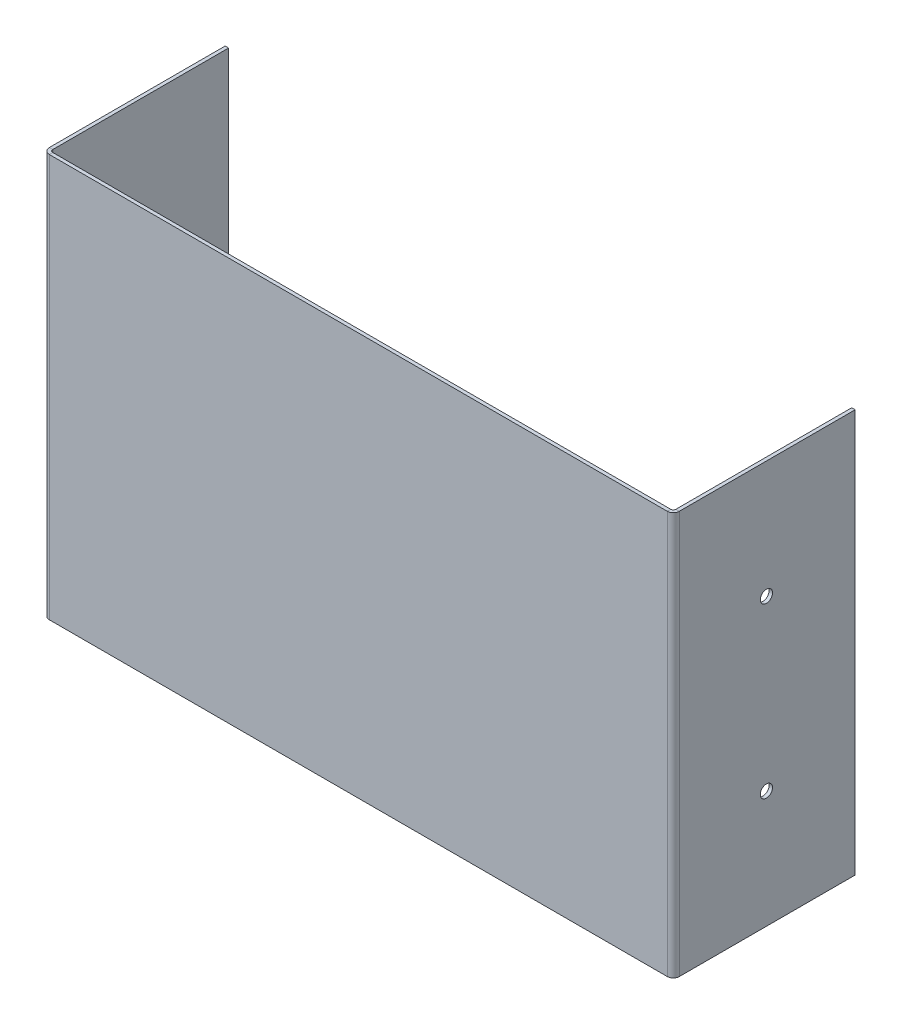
ISO-10303-21;
HEADER;
FILE_DESCRIPTION(('STEP AP214'),'2;1');
FILE_NAME('part.step','',(''),(''),'','','');
FILE_SCHEMA(('AUTOMOTIVE_DESIGN { 1 0 10303 214 1 1 1 1 }'));
ENDSEC;
DATA;
#1=APPLICATION_CONTEXT('core data for automotive mechanical design processes');
#2=APPLICATION_PROTOCOL_DEFINITION('international standard','automotive_design',2000,#1);
#3=PRODUCT_CONTEXT('',#1,'mechanical');
#4=PRODUCT('Part','Part','',(#3));
#5=PRODUCT_RELATED_PRODUCT_CATEGORY('part','',(#4));
#6=PRODUCT_DEFINITION_FORMATION('','',#4);
#7=PRODUCT_DEFINITION_CONTEXT('part definition',#1,'design');
#8=PRODUCT_DEFINITION('design','',#6,#7);
#9=PRODUCT_DEFINITION_SHAPE('','',#8);
#10=(LENGTH_UNIT() NAMED_UNIT(*) SI_UNIT(.MILLI.,.METRE.));
#11=(NAMED_UNIT(*) PLANE_ANGLE_UNIT() SI_UNIT($,.RADIAN.));
#12=(NAMED_UNIT(*) SI_UNIT($,.STERADIAN.) SOLID_ANGLE_UNIT());
#13=UNCERTAINTY_MEASURE_WITH_UNIT(LENGTH_MEASURE(1.E-05),#10,'distance_accuracy_value','');
#14=(GEOMETRIC_REPRESENTATION_CONTEXT(3) GLOBAL_UNCERTAINTY_ASSIGNED_CONTEXT((#13)) GLOBAL_UNIT_ASSIGNED_CONTEXT((#10,
#11,#12)) REPRESENTATION_CONTEXT('',''));
#15=CARTESIAN_POINT('',(0.,0.,0.));
#16=DIRECTION('',(0.,0.,1.));
#17=DIRECTION('',(1.,0.,0.));
#18=AXIS2_PLACEMENT_3D('',#15,#16,#17);
#19=CARTESIAN_POINT('',(-90.1446,-57.658,-0.9906));
#20=DIRECTION('',(0.,0.,1.));
#21=DIRECTION('',(1.,0.,0.));
#22=AXIS2_PLACEMENT_3D('',#19,#20,#21);
#23=PLANE('',#22);
#24=DIRECTION('',(0.,-1.,0.));
#25=VECTOR('',#24,1.);
#26=CARTESIAN_POINT('',(88.4174,-57.658,-0.990600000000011));
#27=LINE('',#26,#25);
#28=CARTESIAN_POINT('',(88.4174,-57.658,-0.990600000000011));
#29=VERTEX_POINT('',#28);
#30=CARTESIAN_POINT('',(88.4174,57.658,-0.990600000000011));
#31=VERTEX_POINT('',#30);
#32=EDGE_CURVE('E217',#29,#31,#27,.F.);
#33=ORIENTED_EDGE('',*,*,#32,.F.);
#34=DIRECTION('',(1.,0.,0.));
#35=VECTOR('',#34,1.);
#36=CARTESIAN_POINT('',(-90.1446,-57.658,-0.9906));
#37=LINE('',#36,#35);
#38=CARTESIAN_POINT('',(-88.4174,-57.658,-0.990600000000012));
#39=VERTEX_POINT('',#38);
#40=EDGE_CURVE('E81',#39,#29,#37,.T.);
#41=ORIENTED_EDGE('',*,*,#40,.F.);
#42=DIRECTION('',(0.,1.,0.));
#43=VECTOR('',#42,1.);
#44=CARTESIAN_POINT('',(-88.4174,57.658,-0.990599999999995));
#45=LINE('',#44,#43);
#46=CARTESIAN_POINT('',(-88.4174,57.658,-0.990599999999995));
#47=VERTEX_POINT('',#46);
#48=EDGE_CURVE('E268',#47,#39,#45,.F.);
#49=ORIENTED_EDGE('',*,*,#48,.F.);
#50=DIRECTION('',(-1.,0.,0.));
#51=VECTOR('',#50,1.);
#52=CARTESIAN_POINT('',(-90.1446,57.658,-0.9906));
#53=LINE('',#52,#51);
#54=EDGE_CURVE('E13',#31,#47,#53,.T.);
#55=ORIENTED_EDGE('',*,*,#54,.F.);
#56=EDGE_LOOP('',(#33,#41,#49,#55));
#57=FACE_BOUND('',#56,.T.);
#58=ADVANCED_FACE('F72',(#57),#23,.F.);
#59=CARTESIAN_POINT('',(-90.1446,-57.658,0.));
#60=DIRECTION('',(0.,0.,1.));
#61=DIRECTION('',(1.,0.,0.));
#62=AXIS2_PLACEMENT_3D('',#59,#60,#61);
#63=PLANE('',#62);
#64=DIRECTION('',(1.,0.,0.));
#65=VECTOR('',#64,1.);
#66=CARTESIAN_POINT('',(-90.1446,-57.658,0.));
#67=LINE('',#66,#65);
#68=CARTESIAN_POINT('',(-88.4174,-57.658,0.));
#69=VERTEX_POINT('',#68);
#70=CARTESIAN_POINT('',(88.4174,-57.658,0.));
#71=VERTEX_POINT('',#70);
#72=EDGE_CURVE('E274',#69,#71,#67,.T.);
#73=ORIENTED_EDGE('',*,*,#72,.T.);
#74=DIRECTION('',(0.,-1.,0.));
#75=VECTOR('',#74,1.);
#76=CARTESIAN_POINT('',(88.4174,-57.658,0.));
#77=LINE('',#76,#75);
#78=CARTESIAN_POINT('',(88.4174,57.658,0.));
#79=VERTEX_POINT('',#78);
#80=EDGE_CURVE('E206',#71,#79,#77,.F.);
#81=ORIENTED_EDGE('',*,*,#80,.T.);
#82=DIRECTION('',(-1.,0.,0.));
#83=VECTOR('',#82,1.);
#84=CARTESIAN_POINT('',(-90.1446,57.658,0.));
#85=LINE('',#84,#83);
#86=CARTESIAN_POINT('',(-88.4174,57.658,0.));
#87=VERTEX_POINT('',#86);
#88=EDGE_CURVE('E76',#79,#87,#85,.T.);
#89=ORIENTED_EDGE('',*,*,#88,.T.);
#90=DIRECTION('',(0.,1.,0.));
#91=VECTOR('',#90,1.);
#92=CARTESIAN_POINT('',(-88.4174,57.658,0.));
#93=LINE('',#92,#91);
#94=EDGE_CURVE('E257',#87,#69,#93,.F.);
#95=ORIENTED_EDGE('',*,*,#94,.T.);
#96=EDGE_LOOP('',(#73,#81,#89,#95));
#97=FACE_BOUND('',#96,.T.);
#98=ADVANCED_FACE('F283',(#97),#63,.T.);
#99=CARTESIAN_POINT('',(-90.1446,-57.658,-0.9906));
#100=DIRECTION('',(0.,-1.,0.));
#101=DIRECTION('',(0.,0.,-1.));
#102=AXIS2_PLACEMENT_3D('',#99,#100,#101);
#103=PLANE('',#102);
#104=ORIENTED_EDGE('',*,*,#40,.T.);
#105=DIRECTION('',(0.,0.,1.));
#106=VECTOR('',#105,1.);
#107=CARTESIAN_POINT('',(88.4174,-57.658,-0.990600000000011));
#108=LINE('',#107,#106);
#109=EDGE_CURVE('E211',#29,#71,#108,.T.);
#110=ORIENTED_EDGE('',*,*,#109,.T.);
#111=ORIENTED_EDGE('',*,*,#72,.F.);
#112=DIRECTION('',(0.,0.,1.));
#113=VECTOR('',#112,1.);
#114=CARTESIAN_POINT('',(-88.4174,-57.658,-0.990600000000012));
#115=LINE('',#114,#113);
#116=EDGE_CURVE('E272',#39,#69,#115,.T.);
#117=ORIENTED_EDGE('',*,*,#116,.F.);
#118=EDGE_LOOP('',(#104,#110,#111,#117));
#119=FACE_BOUND('',#118,.T.);
#120=ADVANCED_FACE('F74',(#119),#103,.T.);
#121=CARTESIAN_POINT('',(-90.1446,57.658,-0.9906));
#122=DIRECTION('',(0.,1.,0.));
#123=DIRECTION('',(0.,0.,1.));
#124=AXIS2_PLACEMENT_3D('',#121,#122,#123);
#125=PLANE('',#124);
#126=DIRECTION('',(0.,0.,1.));
#127=VECTOR('',#126,1.);
#128=CARTESIAN_POINT('',(88.4174,57.658,-0.990600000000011));
#129=LINE('',#128,#127);
#130=EDGE_CURVE('E222',#31,#79,#129,.T.);
#131=ORIENTED_EDGE('',*,*,#130,.F.);
#132=ORIENTED_EDGE('',*,*,#54,.T.);
#133=DIRECTION('',(0.,0.,1.));
#134=VECTOR('',#133,1.);
#135=CARTESIAN_POINT('',(-88.4174,57.658,-0.990599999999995));
#136=LINE('',#135,#134);
#137=EDGE_CURVE('E262',#47,#87,#136,.T.);
#138=ORIENTED_EDGE('',*,*,#137,.T.);
#139=ORIENTED_EDGE('',*,*,#88,.F.);
#140=EDGE_LOOP('',(#131,#132,#138,#139));
#141=FACE_BOUND('',#140,.T.);
#142=ADVANCED_FACE('F286',(#141),#125,.T.);
#143=CARTESIAN_POINT('',(-88.4174,-57.658,-1.7272));
#144=DIRECTION('',(0.,-1.,0.));
#145=DIRECTION('',(0.,0.,-1.));
#146=AXIS2_PLACEMENT_3D('',#143,#144,#145);
#147=PLANE('',#146);
#148=DIRECTION('',(1.,0.,0.));
#149=VECTOR('',#148,1.);
#150=CARTESIAN_POINT('',(-90.1446,-57.658,-1.72719999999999));
#151=LINE('',#150,#149);
#152=CARTESIAN_POINT('',(-89.154,-57.658,-1.7272));
#153=VERTEX_POINT('',#152);
#154=CARTESIAN_POINT('',(-90.1446,-57.658,-1.7272));
#155=VERTEX_POINT('',#154);
#156=EDGE_CURVE('E224',#153,#155,#151,.F.);
#157=ORIENTED_EDGE('',*,*,#156,.F.);
#158=CARTESIAN_POINT('',(-88.4174,-57.658,-1.7272));
#159=DIRECTION('',(0.,1.,0.));
#160=DIRECTION('',(0.,0.,1.));
#161=AXIS2_PLACEMENT_3D('',#158,#159,#160);
#162=CIRCLE('',#161,0.73659999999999);
#163=EDGE_CURVE('E265',#39,#153,#162,.F.);
#164=ORIENTED_EDGE('',*,*,#163,.F.);
#165=ORIENTED_EDGE('',*,*,#116,.T.);
#166=CARTESIAN_POINT('',(-88.4174,-57.658,-1.7272));
#167=DIRECTION('',(0.,1.,0.));
#168=DIRECTION('',(0.,0.,1.));
#169=AXIS2_PLACEMENT_3D('',#166,#167,#168);
#170=CIRCLE('',#169,1.72719999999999);
#171=EDGE_CURVE('E89',#69,#155,#170,.F.);
#172=ORIENTED_EDGE('',*,*,#171,.T.);
#173=EDGE_LOOP('',(#157,#164,#165,#172));
#174=FACE_BOUND('',#173,.T.);
#175=ADVANCED_FACE('F318',(#174),#147,.T.);
#176=CARTESIAN_POINT('',(-88.4174,57.658,-1.72719999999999));
#177=DIRECTION('',(0.,-1.,0.));
#178=DIRECTION('',(0.,0.,-1.));
#179=AXIS2_PLACEMENT_3D('',#176,#177,#178);
#180=PLANE('',#179);
#181=CARTESIAN_POINT('',(-88.4174,57.658,-1.72719999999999));
#182=DIRECTION('',(0.,1.,0.));
#183=DIRECTION('',(0.,0.,1.));
#184=AXIS2_PLACEMENT_3D('',#181,#182,#183);
#185=CIRCLE('',#184,0.73659999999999);
#186=CARTESIAN_POINT('',(-89.154,57.658,-1.72719999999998));
#187=VERTEX_POINT('',#186);
#188=EDGE_CURVE('E230',#187,#47,#185,.T.);
#189=ORIENTED_EDGE('',*,*,#188,.F.);
#190=DIRECTION('',(1.,0.,0.));
#191=VECTOR('',#190,1.);
#192=CARTESIAN_POINT('',(-89.154,57.658,-1.72719999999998));
#193=LINE('',#192,#191);
#194=CARTESIAN_POINT('',(-90.1446,57.658,-1.72719999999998));
#195=VERTEX_POINT('',#194);
#196=EDGE_CURVE('E250',#187,#195,#193,.F.);
#197=ORIENTED_EDGE('',*,*,#196,.T.);
#198=CARTESIAN_POINT('',(-88.4174,57.658,-1.72719999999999));
#199=DIRECTION('',(0.,1.,0.));
#200=DIRECTION('',(0.,0.,1.));
#201=AXIS2_PLACEMENT_3D('',#198,#199,#200);
#202=CIRCLE('',#201,1.72719999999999);
#203=EDGE_CURVE('E260',#195,#87,#202,.T.);
#204=ORIENTED_EDGE('',*,*,#203,.T.);
#205=ORIENTED_EDGE('',*,*,#137,.F.);
#206=EDGE_LOOP('',(#189,#197,#204,#205));
#207=FACE_BOUND('',#206,.T.);
#208=ADVANCED_FACE('F291',(#207),#180,.F.);
#209=CARTESIAN_POINT('',(-88.4174,57.658,-1.72719999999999));
#210=DIRECTION('',(0.,1.,0.));
#211=DIRECTION('',(-1.,0.,0.));
#212=AXIS2_PLACEMENT_3D('',#209,#210,#211);
#213=CYLINDRICAL_SURFACE('',#212,1.72719999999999);
#214=ORIENTED_EDGE('',*,*,#94,.F.);
#215=ORIENTED_EDGE('',*,*,#203,.F.);
#216=DIRECTION('',(0.,1.,0.));
#217=VECTOR('',#216,1.);
#218=CARTESIAN_POINT('',(-90.1446,-57.658,-1.72719999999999));
#219=LINE('',#218,#217);
#220=EDGE_CURVE('E248',#195,#155,#219,.F.);
#221=ORIENTED_EDGE('',*,*,#220,.T.);
#222=ORIENTED_EDGE('',*,*,#171,.F.);
#223=EDGE_LOOP('',(#214,#215,#221,#222));
#224=FACE_BOUND('',#223,.T.);
#225=ADVANCED_FACE('F316',(#224),#213,.T.);
#226=CARTESIAN_POINT('',(-88.4174,57.658,-1.72719999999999));
#227=DIRECTION('',(0.,1.,0.));
#228=DIRECTION('',(-1.,0.,0.));
#229=AXIS2_PLACEMENT_3D('',#226,#227,#228);
#230=CYLINDRICAL_SURFACE('',#229,0.73659999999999);
#231=ORIENTED_EDGE('',*,*,#48,.T.);
#232=ORIENTED_EDGE('',*,*,#163,.T.);
#233=DIRECTION('',(0.,1.,0.));
#234=VECTOR('',#233,1.);
#235=CARTESIAN_POINT('',(-89.154,-57.658,-1.7272));
#236=LINE('',#235,#234);
#237=EDGE_CURVE('E253',#153,#187,#236,.T.);
#238=ORIENTED_EDGE('',*,*,#237,.T.);
#239=ORIENTED_EDGE('',*,*,#188,.T.);
#240=EDGE_LOOP('',(#231,#232,#238,#239));
#241=FACE_BOUND('',#240,.T.);
#242=ADVANCED_FACE('F294',(#241),#230,.F.);
#243=CARTESIAN_POINT('',(-90.1446000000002,57.658,-52.0446));
#244=DIRECTION('',(0.,-1.,0.));
#245=DIRECTION('',(0.,0.,-1.));
#246=AXIS2_PLACEMENT_3D('',#243,#244,#245);
#247=PLANE('',#246);
#248=ORIENTED_EDGE('',*,*,#196,.F.);
#249=DIRECTION('',(0.,0.,1.));
#250=VECTOR('',#249,1.);
#251=CARTESIAN_POINT('',(-89.1540000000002,57.658,-52.0446));
#252=LINE('',#251,#250);
#253=CARTESIAN_POINT('',(-89.1540000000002,57.658,-52.0446));
#254=VERTEX_POINT('',#253);
#255=EDGE_CURVE('E246',#187,#254,#252,.F.);
#256=ORIENTED_EDGE('',*,*,#255,.T.);
#257=DIRECTION('',(1.,0.,0.));
#258=VECTOR('',#257,1.);
#259=CARTESIAN_POINT('',(-90.1446000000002,57.658,-52.0446));
#260=LINE('',#259,#258);
#261=CARTESIAN_POINT('',(-90.1446000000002,57.658,-52.0446));
#262=VERTEX_POINT('',#261);
#263=EDGE_CURVE('E227',#262,#254,#260,.T.);
#264=ORIENTED_EDGE('',*,*,#263,.F.);
#265=DIRECTION('',(0.,0.,-1.));
#266=VECTOR('',#265,1.);
#267=CARTESIAN_POINT('',(-90.1446,57.658,-0.990600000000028));
#268=LINE('',#267,#266);
#269=EDGE_CURVE('E239',#195,#262,#268,.T.);
#270=ORIENTED_EDGE('',*,*,#269,.F.);
#271=EDGE_LOOP('',(#248,#256,#264,#270));
#272=FACE_BOUND('',#271,.T.);
#273=ADVANCED_FACE('F312',(#272),#247,.F.);
#274=CARTESIAN_POINT('',(-90.1446,-57.658,-0.990599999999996));
#275=DIRECTION('',(0.,1.,0.));
#276=DIRECTION('',(-1.,0.,0.));
#277=AXIS2_PLACEMENT_3D('',#274,#275,#276);
#278=PLANE('',#277);
#279=ORIENTED_EDGE('',*,*,#156,.T.);
#280=DIRECTION('',(0.,0.,1.));
#281=VECTOR('',#280,1.);
#282=CARTESIAN_POINT('',(-90.1446,-57.658,-0.990599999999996));
#283=LINE('',#282,#281);
#284=CARTESIAN_POINT('',(-90.1446000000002,-57.658,-52.0446));
#285=VERTEX_POINT('',#284);
#286=EDGE_CURVE('E234',#285,#155,#283,.T.);
#287=ORIENTED_EDGE('',*,*,#286,.F.);
#288=DIRECTION('',(1.,0.,0.));
#289=VECTOR('',#288,1.);
#290=CARTESIAN_POINT('',(-90.1446000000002,-57.658,-52.0446));
#291=LINE('',#290,#289);
#292=CARTESIAN_POINT('',(-89.1540000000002,-57.658,-52.0446));
#293=VERTEX_POINT('',#292);
#294=EDGE_CURVE('E231',#285,#293,#291,.T.);
#295=ORIENTED_EDGE('',*,*,#294,.T.);
#296=DIRECTION('',(0.,0.,-1.));
#297=VECTOR('',#296,1.);
#298=CARTESIAN_POINT('',(-89.154,-57.658,-0.9906));
#299=LINE('',#298,#297);
#300=EDGE_CURVE('E241',#293,#153,#299,.F.);
#301=ORIENTED_EDGE('',*,*,#300,.T.);
#302=EDGE_LOOP('',(#279,#287,#295,#301));
#303=FACE_BOUND('',#302,.T.);
#304=ADVANCED_FACE('F303',(#303),#278,.F.);
#305=CARTESIAN_POINT('',(-90.1446,-57.658,-0.990599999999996));
#306=DIRECTION('',(1.,0.,0.));
#307=DIRECTION('',(0.,0.,-1.));
#308=AXIS2_PLACEMENT_3D('',#305,#306,#307);
#309=PLANE('',#308);
#310=CARTESIAN_POINT('',(-90.1446000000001,24.13,-26.6445999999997));
#311=DIRECTION('',(-1.,0.,0.));
#312=DIRECTION('',(0.,0.,1.));
#313=AXIS2_PLACEMENT_3D('',#310,#311,#312);
#314=CIRCLE('',#313,1.75259999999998);
#315=CARTESIAN_POINT('',(-90.1446000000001,24.13,-24.8919999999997));
#316=VERTEX_POINT('',#315);
#317=EDGE_CURVE('E604',#316,#316,#314,.T.);
#318=ORIENTED_EDGE('',*,*,#317,.F.);
#319=EDGE_LOOP('',(#318));
#320=FACE_BOUND('',#319,.T.);
#321=CARTESIAN_POINT('',(-90.1446000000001,-24.13,-26.6445999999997));
#322=DIRECTION('',(-1.,0.,0.));
#323=DIRECTION('',(0.,0.,1.));
#324=AXIS2_PLACEMENT_3D('',#321,#322,#323);
#325=CIRCLE('',#324,1.7526);
#326=CARTESIAN_POINT('',(-90.1446000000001,-24.13,-24.8919999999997));
#327=VERTEX_POINT('',#326);
#328=EDGE_CURVE('E610',#327,#327,#325,.T.);
#329=ORIENTED_EDGE('',*,*,#328,.F.);
#330=EDGE_LOOP('',(#329));
#331=FACE_BOUND('',#330,.T.);
#332=ORIENTED_EDGE('',*,*,#220,.F.);
#333=ORIENTED_EDGE('',*,*,#269,.T.);
#334=DIRECTION('',(0.,-1.,0.));
#335=VECTOR('',#334,1.);
#336=CARTESIAN_POINT('',(-90.1446000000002,-57.658,-52.0446));
#337=LINE('',#336,#335);
#338=EDGE_CURVE('E237',#262,#285,#337,.T.);
#339=ORIENTED_EDGE('',*,*,#338,.T.);
#340=ORIENTED_EDGE('',*,*,#286,.T.);
#341=EDGE_LOOP('',(#332,#333,#339,#340));
#342=FACE_BOUND('',#341,.T.);
#343=ADVANCED_FACE('F315',(#320,#331,#342),#309,.F.);
#344=CARTESIAN_POINT('',(-89.154,-57.658,-0.9906));
#345=DIRECTION('',(1.,0.,0.));
#346=DIRECTION('',(0.,0.,-1.));
#347=AXIS2_PLACEMENT_3D('',#344,#345,#346);
#348=PLANE('',#347);
#349=CARTESIAN_POINT('',(-89.1540000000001,24.13,-26.6445999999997));
#350=DIRECTION('',(1.,0.,0.));
#351=DIRECTION('',(0.,0.,-1.));
#352=AXIS2_PLACEMENT_3D('',#349,#350,#351);
#353=CIRCLE('',#352,1.75259999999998);
#354=CARTESIAN_POINT('',(-89.1540000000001,24.13,-28.3971999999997));
#355=VERTEX_POINT('',#354);
#356=EDGE_CURVE('E607',#355,#355,#353,.F.);
#357=ORIENTED_EDGE('',*,*,#356,.T.);
#358=EDGE_LOOP('',(#357));
#359=FACE_BOUND('',#358,.T.);
#360=CARTESIAN_POINT('',(-89.1540000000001,-24.13,-26.6445999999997));
#361=DIRECTION('',(1.,0.,0.));
#362=DIRECTION('',(0.,0.,-1.));
#363=AXIS2_PLACEMENT_3D('',#360,#361,#362);
#364=CIRCLE('',#363,1.7526);
#365=CARTESIAN_POINT('',(-89.1540000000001,-24.13,-28.3971999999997));
#366=VERTEX_POINT('',#365);
#367=EDGE_CURVE('E205',#366,#366,#364,.F.);
#368=ORIENTED_EDGE('',*,*,#367,.T.);
#369=EDGE_LOOP('',(#368));
#370=FACE_BOUND('',#369,.T.);
#371=ORIENTED_EDGE('',*,*,#255,.F.);
#372=ORIENTED_EDGE('',*,*,#237,.F.);
#373=ORIENTED_EDGE('',*,*,#300,.F.);
#374=DIRECTION('',(0.,1.,0.));
#375=VECTOR('',#374,1.);
#376=CARTESIAN_POINT('',(-89.1540000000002,-57.658,-52.0446));
#377=LINE('',#376,#375);
#378=EDGE_CURVE('E244',#254,#293,#377,.F.);
#379=ORIENTED_EDGE('',*,*,#378,.F.);
#380=EDGE_LOOP('',(#371,#372,#373,#379));
#381=FACE_BOUND('',#380,.T.);
#382=ADVANCED_FACE('F300',(#359,#370,#381),#348,.T.);
#383=CARTESIAN_POINT('',(-90.1446000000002,-57.658,-52.0446));
#384=DIRECTION('',(0.,0.,1.));
#385=DIRECTION('',(1.,0.,0.));
#386=AXIS2_PLACEMENT_3D('',#383,#384,#385);
#387=PLANE('',#386);
#388=ORIENTED_EDGE('',*,*,#378,.T.);
#389=ORIENTED_EDGE('',*,*,#294,.F.);
#390=ORIENTED_EDGE('',*,*,#338,.F.);
#391=ORIENTED_EDGE('',*,*,#263,.T.);
#392=EDGE_LOOP('',(#388,#389,#390,#391));
#393=FACE_BOUND('',#392,.T.);
#394=ADVANCED_FACE('F308',(#393),#387,.F.);
#395=CARTESIAN_POINT('',(88.4174,57.658,-1.7272));
#396=DIRECTION('',(0.,1.,0.));
#397=DIRECTION('',(0.,0.,1.));
#398=AXIS2_PLACEMENT_3D('',#395,#396,#397);
#399=PLANE('',#398);
#400=DIRECTION('',(-1.,0.,0.));
#401=VECTOR('',#400,1.);
#402=CARTESIAN_POINT('',(90.1446,57.658,-1.72719999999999));
#403=LINE('',#402,#401);
#404=CARTESIAN_POINT('',(89.154,57.658,-1.7272));
#405=VERTEX_POINT('',#404);
#406=CARTESIAN_POINT('',(90.1446,57.658,-1.72719999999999));
#407=VERTEX_POINT('',#406);
#408=EDGE_CURVE('E187',#405,#407,#403,.F.);
#409=ORIENTED_EDGE('',*,*,#408,.F.);
#410=CARTESIAN_POINT('',(88.4174,57.658,-1.7272));
#411=DIRECTION('',(0.,-1.,0.));
#412=DIRECTION('',(0.,0.,-1.));
#413=AXIS2_PLACEMENT_3D('',#410,#411,#412);
#414=CIRCLE('',#413,0.73659999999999);
#415=EDGE_CURVE('E214',#31,#405,#414,.F.);
#416=ORIENTED_EDGE('',*,*,#415,.F.);
#417=ORIENTED_EDGE('',*,*,#130,.T.);
#418=CARTESIAN_POINT('',(88.4174,57.658,-1.7272));
#419=DIRECTION('',(0.,-1.,0.));
#420=DIRECTION('',(0.,0.,-1.));
#421=AXIS2_PLACEMENT_3D('',#418,#419,#420);
#422=CIRCLE('',#421,1.72719999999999);
#423=EDGE_CURVE('E97',#79,#407,#422,.F.);
#424=ORIENTED_EDGE('',*,*,#423,.T.);
#425=EDGE_LOOP('',(#409,#416,#417,#424));
#426=FACE_BOUND('',#425,.T.);
#427=ADVANCED_FACE('F330',(#426),#399,.T.);
#428=CARTESIAN_POINT('',(88.4174,-57.658,-1.7272));
#429=DIRECTION('',(0.,1.,0.));
#430=DIRECTION('',(0.,0.,1.));
#431=AXIS2_PLACEMENT_3D('',#428,#429,#430);
#432=PLANE('',#431);
#433=CARTESIAN_POINT('',(88.4174,-57.658,-1.7272));
#434=DIRECTION('',(0.,-1.,0.));
#435=DIRECTION('',(0.,0.,-1.));
#436=AXIS2_PLACEMENT_3D('',#433,#434,#435);
#437=CIRCLE('',#436,0.73659999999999);
#438=CARTESIAN_POINT('',(89.154,-57.658,-1.7272));
#439=VERTEX_POINT('',#438);
#440=EDGE_CURVE('E219',#439,#29,#437,.T.);
#441=ORIENTED_EDGE('',*,*,#440,.F.);
#442=DIRECTION('',(-1.,0.,0.));
#443=VECTOR('',#442,1.);
#444=CARTESIAN_POINT('',(89.154,-57.658,-1.7272));
#445=LINE('',#444,#443);
#446=CARTESIAN_POINT('',(90.1446,-57.658,-1.72719999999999));
#447=VERTEX_POINT('',#446);
#448=EDGE_CURVE('E199',#439,#447,#445,.F.);
#449=ORIENTED_EDGE('',*,*,#448,.T.);
#450=CARTESIAN_POINT('',(88.4174,-57.658,-1.7272));
#451=DIRECTION('',(0.,-1.,0.));
#452=DIRECTION('',(0.,0.,-1.));
#453=AXIS2_PLACEMENT_3D('',#450,#451,#452);
#454=CIRCLE('',#453,1.72719999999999);
#455=EDGE_CURVE('E209',#447,#71,#454,.T.);
#456=ORIENTED_EDGE('',*,*,#455,.T.);
#457=ORIENTED_EDGE('',*,*,#109,.F.);
#458=EDGE_LOOP('',(#441,#449,#456,#457));
#459=FACE_BOUND('',#458,.T.);
#460=ADVANCED_FACE('F332',(#459),#432,.F.);
#461=CARTESIAN_POINT('',(88.4174,-57.658,-1.7272));
#462=DIRECTION('',(0.,-1.,0.));
#463=DIRECTION('',(1.,0.,0.));
#464=AXIS2_PLACEMENT_3D('',#461,#462,#463);
#465=CYLINDRICAL_SURFACE('',#464,1.72719999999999);
#466=ORIENTED_EDGE('',*,*,#80,.F.);
#467=ORIENTED_EDGE('',*,*,#455,.F.);
#468=DIRECTION('',(0.,-1.,0.));
#469=VECTOR('',#468,1.);
#470=CARTESIAN_POINT('',(90.1446,57.658,-1.72719999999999));
#471=LINE('',#470,#469);
#472=EDGE_CURVE('E197',#447,#407,#471,.F.);
#473=ORIENTED_EDGE('',*,*,#472,.T.);
#474=ORIENTED_EDGE('',*,*,#423,.F.);
#475=EDGE_LOOP('',(#466,#467,#473,#474));
#476=FACE_BOUND('',#475,.T.);
#477=ADVANCED_FACE('F334',(#476),#465,.T.);
#478=CARTESIAN_POINT('',(88.4174,-57.658,-1.7272));
#479=DIRECTION('',(0.,-1.,0.));
#480=DIRECTION('',(1.,0.,0.));
#481=AXIS2_PLACEMENT_3D('',#478,#479,#480);
#482=CYLINDRICAL_SURFACE('',#481,0.73659999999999);
#483=ORIENTED_EDGE('',*,*,#32,.T.);
#484=ORIENTED_EDGE('',*,*,#415,.T.);
#485=DIRECTION('',(0.,-1.,0.));
#486=VECTOR('',#485,1.);
#487=CARTESIAN_POINT('',(89.154,57.658,-1.7272));
#488=LINE('',#487,#486);
#489=EDGE_CURVE('E202',#405,#439,#488,.T.);
#490=ORIENTED_EDGE('',*,*,#489,.T.);
#491=ORIENTED_EDGE('',*,*,#440,.T.);
#492=EDGE_LOOP('',(#483,#484,#490,#491));
#493=FACE_BOUND('',#492,.T.);
#494=ADVANCED_FACE('F326',(#493),#482,.F.);
#495=CARTESIAN_POINT('',(90.1446000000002,-57.658,-52.0446));
#496=DIRECTION('',(0.,1.,0.));
#497=DIRECTION('',(0.,0.,1.));
#498=AXIS2_PLACEMENT_3D('',#495,#496,#497);
#499=PLANE('',#498);
#500=ORIENTED_EDGE('',*,*,#448,.F.);
#501=DIRECTION('',(0.,0.,1.));
#502=VECTOR('',#501,1.);
#503=CARTESIAN_POINT('',(89.1540000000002,-57.658,-52.0446));
#504=LINE('',#503,#502);
#505=CARTESIAN_POINT('',(89.1540000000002,-57.658,-52.0446));
#506=VERTEX_POINT('',#505);
#507=EDGE_CURVE('E195',#439,#506,#504,.F.);
#508=ORIENTED_EDGE('',*,*,#507,.T.);
#509=DIRECTION('',(-1.,0.,0.));
#510=VECTOR('',#509,1.);
#511=CARTESIAN_POINT('',(90.1446000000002,-57.658,-52.0446));
#512=LINE('',#511,#510);
#513=CARTESIAN_POINT('',(90.1446000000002,-57.658,-52.0446));
#514=VERTEX_POINT('',#513);
#515=EDGE_CURVE('E183',#514,#506,#512,.T.);
#516=ORIENTED_EDGE('',*,*,#515,.F.);
#517=DIRECTION('',(0.,0.,-1.));
#518=VECTOR('',#517,1.);
#519=CARTESIAN_POINT('',(90.1446,-57.658,-0.990599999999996));
#520=LINE('',#519,#518);
#521=EDGE_CURVE('E170',#447,#514,#520,.T.);
#522=ORIENTED_EDGE('',*,*,#521,.F.);
#523=EDGE_LOOP('',(#500,#508,#516,#522));
#524=FACE_BOUND('',#523,.T.);
#525=ADVANCED_FACE('F483',(#524),#499,.F.);
#526=CARTESIAN_POINT('',(90.1446,57.658,-0.990599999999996));
#527=DIRECTION('',(0.,-1.,0.));
#528=DIRECTION('',(1.,0.,0.));
#529=AXIS2_PLACEMENT_3D('',#526,#527,#528);
#530=PLANE('',#529);
#531=ORIENTED_EDGE('',*,*,#408,.T.);
#532=DIRECTION('',(0.,0.,1.));
#533=VECTOR('',#532,1.);
#534=CARTESIAN_POINT('',(90.1446,57.658,-0.990599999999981));
#535=LINE('',#534,#533);
#536=CARTESIAN_POINT('',(90.1446000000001,57.658,-52.0446));
#537=VERTEX_POINT('',#536);
#538=EDGE_CURVE('E168',#537,#407,#535,.T.);
#539=ORIENTED_EDGE('',*,*,#538,.F.);
#540=DIRECTION('',(-1.,0.,0.));
#541=VECTOR('',#540,1.);
#542=CARTESIAN_POINT('',(90.1446000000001,57.658,-52.0446));
#543=LINE('',#542,#541);
#544=CARTESIAN_POINT('',(89.1540000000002,57.658,-52.0446));
#545=VERTEX_POINT('',#544);
#546=EDGE_CURVE('E176',#537,#545,#543,.T.);
#547=ORIENTED_EDGE('',*,*,#546,.T.);
#548=DIRECTION('',(0.,0.,-1.));
#549=VECTOR('',#548,1.);
#550=CARTESIAN_POINT('',(89.154,57.658,-0.9906));
#551=LINE('',#550,#549);
#552=EDGE_CURVE('E192',#545,#405,#551,.F.);
#553=ORIENTED_EDGE('',*,*,#552,.T.);
#554=EDGE_LOOP('',(#531,#539,#547,#553));
#555=FACE_BOUND('',#554,.T.);
#556=ADVANCED_FACE('F186',(#555),#530,.F.);
#557=CARTESIAN_POINT('',(90.1446,-57.658,-0.990599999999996));
#558=DIRECTION('',(-1.,0.,0.));
#559=DIRECTION('',(0.,0.,1.));
#560=AXIS2_PLACEMENT_3D('',#557,#558,#559);
#561=PLANE('',#560);
#562=CARTESIAN_POINT('',(90.1446000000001,-24.13,-26.6445999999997));
#563=DIRECTION('',(1.,0.,0.));
#564=DIRECTION('',(0.,0.,-1.));
#565=AXIS2_PLACEMENT_3D('',#562,#563,#564);
#566=CIRCLE('',#565,1.7526);
#567=CARTESIAN_POINT('',(90.1446000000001,-24.13,-28.3971999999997));
#568=VERTEX_POINT('',#567);
#569=EDGE_CURVE('E591',#568,#568,#566,.T.);
#570=ORIENTED_EDGE('',*,*,#569,.F.);
#571=EDGE_LOOP('',(#570));
#572=FACE_BOUND('',#571,.T.);
#573=CARTESIAN_POINT('',(90.1446000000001,24.13,-26.6445999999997));
#574=DIRECTION('',(1.,0.,0.));
#575=DIRECTION('',(0.,0.,-1.));
#576=AXIS2_PLACEMENT_3D('',#573,#574,#575);
#577=CIRCLE('',#576,1.7526);
#578=CARTESIAN_POINT('',(90.1446000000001,24.13,-28.3971999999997));
#579=VERTEX_POINT('',#578);
#580=EDGE_CURVE('E595',#579,#579,#577,.T.);
#581=ORIENTED_EDGE('',*,*,#580,.F.);
#582=EDGE_LOOP('',(#581));
#583=FACE_BOUND('',#582,.T.);
#584=ORIENTED_EDGE('',*,*,#472,.F.);
#585=ORIENTED_EDGE('',*,*,#521,.T.);
#586=DIRECTION('',(0.,1.,0.));
#587=VECTOR('',#586,1.);
#588=CARTESIAN_POINT('',(90.1446000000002,-57.658,-52.0446));
#589=LINE('',#588,#587);
#590=EDGE_CURVE('E163',#514,#537,#589,.T.);
#591=ORIENTED_EDGE('',*,*,#590,.T.);
#592=ORIENTED_EDGE('',*,*,#538,.T.);
#593=EDGE_LOOP('',(#584,#585,#591,#592));
#594=FACE_BOUND('',#593,.T.);
#595=ADVANCED_FACE('F166',(#572,#583,#594),#561,.F.);
#596=CARTESIAN_POINT('',(89.154,-57.658,-0.9906));
#597=DIRECTION('',(-1.,0.,0.));
#598=DIRECTION('',(0.,0.,1.));
#599=AXIS2_PLACEMENT_3D('',#596,#597,#598);
#600=PLANE('',#599);
#601=CARTESIAN_POINT('',(89.1540000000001,-24.13,-26.6445999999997));
#602=DIRECTION('',(-1.,0.,0.));
#603=DIRECTION('',(0.,0.,1.));
#604=AXIS2_PLACEMENT_3D('',#601,#602,#603);
#605=CIRCLE('',#604,1.7526);
#606=CARTESIAN_POINT('',(89.1540000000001,-24.13,-24.8919999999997));
#607=VERTEX_POINT('',#606);
#608=EDGE_CURVE('E594',#607,#607,#605,.F.);
#609=ORIENTED_EDGE('',*,*,#608,.T.);
#610=EDGE_LOOP('',(#609));
#611=FACE_BOUND('',#610,.T.);
#612=CARTESIAN_POINT('',(89.1540000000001,24.13,-26.6445999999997));
#613=DIRECTION('',(-1.,0.,0.));
#614=DIRECTION('',(0.,0.,1.));
#615=AXIS2_PLACEMENT_3D('',#612,#613,#614);
#616=CIRCLE('',#615,1.7526);
#617=CARTESIAN_POINT('',(89.1540000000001,24.13,-24.8919999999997));
#618=VERTEX_POINT('',#617);
#619=EDGE_CURVE('E598',#618,#618,#616,.F.);
#620=ORIENTED_EDGE('',*,*,#619,.T.);
#621=EDGE_LOOP('',(#620));
#622=FACE_BOUND('',#621,.T.);
#623=ORIENTED_EDGE('',*,*,#507,.F.);
#624=ORIENTED_EDGE('',*,*,#489,.F.);
#625=ORIENTED_EDGE('',*,*,#552,.F.);
#626=DIRECTION('',(0.,-1.,0.));
#627=VECTOR('',#626,1.);
#628=CARTESIAN_POINT('',(89.1540000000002,57.658,-52.0446));
#629=LINE('',#628,#627);
#630=EDGE_CURVE('E179',#506,#545,#629,.F.);
#631=ORIENTED_EDGE('',*,*,#630,.F.);
#632=EDGE_LOOP('',(#623,#624,#625,#631));
#633=FACE_BOUND('',#632,.T.);
#634=ADVANCED_FACE('F511',(#611,#622,#633),#600,.T.);
#635=CARTESIAN_POINT('',(90.1446000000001,57.658,-52.0446));
#636=DIRECTION('',(0.,0.,1.));
#637=DIRECTION('',(1.,0.,0.));
#638=AXIS2_PLACEMENT_3D('',#635,#636,#637);
#639=PLANE('',#638);
#640=ORIENTED_EDGE('',*,*,#630,.T.);
#641=ORIENTED_EDGE('',*,*,#546,.F.);
#642=ORIENTED_EDGE('',*,*,#590,.F.);
#643=ORIENTED_EDGE('',*,*,#515,.T.);
#644=EDGE_LOOP('',(#640,#641,#642,#643));
#645=FACE_BOUND('',#644,.T.);
#646=ADVANCED_FACE('F177',(#645),#639,.F.);
#647=CARTESIAN_POINT('',(-84.1968986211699,-24.13,-26.6445999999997));
#648=DIRECTION('',(-1.,0.,0.));
#649=DIRECTION('',(0.,0.,1.));
#650=AXIS2_PLACEMENT_3D('',#647,#648,#649);
#651=CYLINDRICAL_SURFACE('',#650,1.7526);
#652=ORIENTED_EDGE('',*,*,#328,.T.);
#653=EDGE_LOOP('',(#652));
#654=FACE_BOUND('',#653,.T.);
#655=ORIENTED_EDGE('',*,*,#367,.F.);
#656=EDGE_LOOP('',(#655));
#657=FACE_BOUND('',#656,.T.);
#658=ADVANCED_FACE('F533',(#654,#657),#651,.F.);
#659=CARTESIAN_POINT('',(-84.1968986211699,24.13,-26.6445999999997));
#660=DIRECTION('',(-1.,0.,0.));
#661=DIRECTION('',(0.,0.,1.));
#662=AXIS2_PLACEMENT_3D('',#659,#660,#661);
#663=CYLINDRICAL_SURFACE('',#662,1.75259999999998);
#664=ORIENTED_EDGE('',*,*,#317,.T.);
#665=EDGE_LOOP('',(#664));
#666=FACE_BOUND('',#665,.T.);
#667=ORIENTED_EDGE('',*,*,#356,.F.);
#668=EDGE_LOOP('',(#667));
#669=FACE_BOUND('',#668,.T.);
#670=ADVANCED_FACE('F542',(#666,#669),#663,.F.);
#671=CARTESIAN_POINT('',(84.1968986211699,24.13,-26.6445999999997));
#672=DIRECTION('',(1.,0.,0.));
#673=DIRECTION('',(0.,0.,-1.));
#674=AXIS2_PLACEMENT_3D('',#671,#672,#673);
#675=CYLINDRICAL_SURFACE('',#674,1.7526);
#676=ORIENTED_EDGE('',*,*,#580,.T.);
#677=EDGE_LOOP('',(#676));
#678=FACE_BOUND('',#677,.T.);
#679=ORIENTED_EDGE('',*,*,#619,.F.);
#680=EDGE_LOOP('',(#679));
#681=FACE_BOUND('',#680,.T.);
#682=ADVANCED_FACE('F552',(#678,#681),#675,.F.);
#683=CARTESIAN_POINT('',(84.1968986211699,-24.13,-26.6445999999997));
#684=DIRECTION('',(1.,0.,0.));
#685=DIRECTION('',(0.,0.,-1.));
#686=AXIS2_PLACEMENT_3D('',#683,#684,#685);
#687=CYLINDRICAL_SURFACE('',#686,1.7526);
#688=ORIENTED_EDGE('',*,*,#569,.T.);
#689=EDGE_LOOP('',(#688));
#690=FACE_BOUND('',#689,.T.);
#691=ORIENTED_EDGE('',*,*,#608,.F.);
#692=EDGE_LOOP('',(#691));
#693=FACE_BOUND('',#692,.T.);
#694=ADVANCED_FACE('F562',(#690,#693),#687,.F.);
#695=CLOSED_SHELL('',(#58,#98,#120,#142,#175,#208,#225,#242,#273,#304,#343,#382,#394,#427,#460,
#477,#494,#525,#556,#595,#634,#646,#658,#670,#682,#694));
#696=MANIFOLD_SOLID_BREP('B2',#695);
#697=ADVANCED_BREP_SHAPE_REPRESENTATION('',(#18,#696),#14);
#698=SHAPE_DEFINITION_REPRESENTATION(#9,#697);
ENDSEC;
END-ISO-10303-21;
